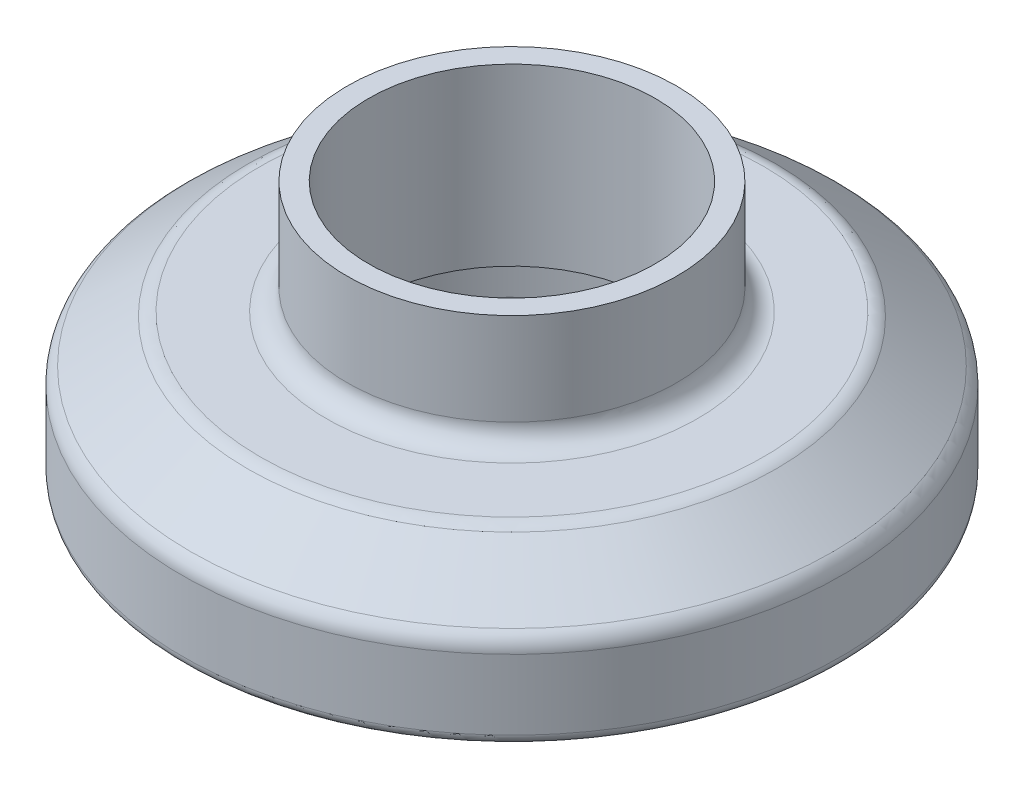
from build123d import *


with BuildPart() as part:
    # Sketch1 → Revolve1 (revolve)
    with BuildSketch(Plane.XY, mode=Mode.PRIVATE) as revolve1_sk:
        with BuildLine():
            Line((-11.049, 19.8374), (-12.7, 19.8374))
            Line((-12.7, 19.8374), (-12.7, 12.7254))
            ThreePointArc((-12.7, 12.7254), (-13.168687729, 11.593887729), (-14.3002, 11.1252))
            Line((-14.3002, 11.1252), (-19.396727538, 11.1252))
            ThreePointArc((-19.396727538, 11.1252), (-19.90447845, 11.042507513), (-20.359751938, 10.802976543))
            Line((-20.359751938, 10.802976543), (-24.7628244, 7.485023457))
            ThreePointArc((-24.7628244, 7.485023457), (-25.231873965, 6.921052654), (-25.4, 6.207046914))
            Line((-25.4, 6.207046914), (-25.4, 0.8128))
            ThreePointArc((-25.4, 0.8128), (-25.161936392, 0.238063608), (-24.5872, 0))
            Line((-24.5872, 0), (-16.764, 0))
            ThreePointArc((-16.764, 0), (-16.189263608, 0.238063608), (-15.9512, 0.8128))
            Line((-15.9512, 0.8128), (-15.9512, 5.5372))
            ThreePointArc((-15.9512, 5.5372), (-15.713136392, 6.111936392), (-15.1384, 6.35))
            Line((-15.1384, 6.35), (-11.049, 6.35))
            Line((-11.049, 6.35), (-11.049, 19.8374))
        make_face()
    revolve(revolve1_sk.sketch.rotate(Axis((0, 0, 0), (0, 1, 0)), 270), axis=Axis((0, 0, 0), (0, 1, 0)))


solid = part.part
